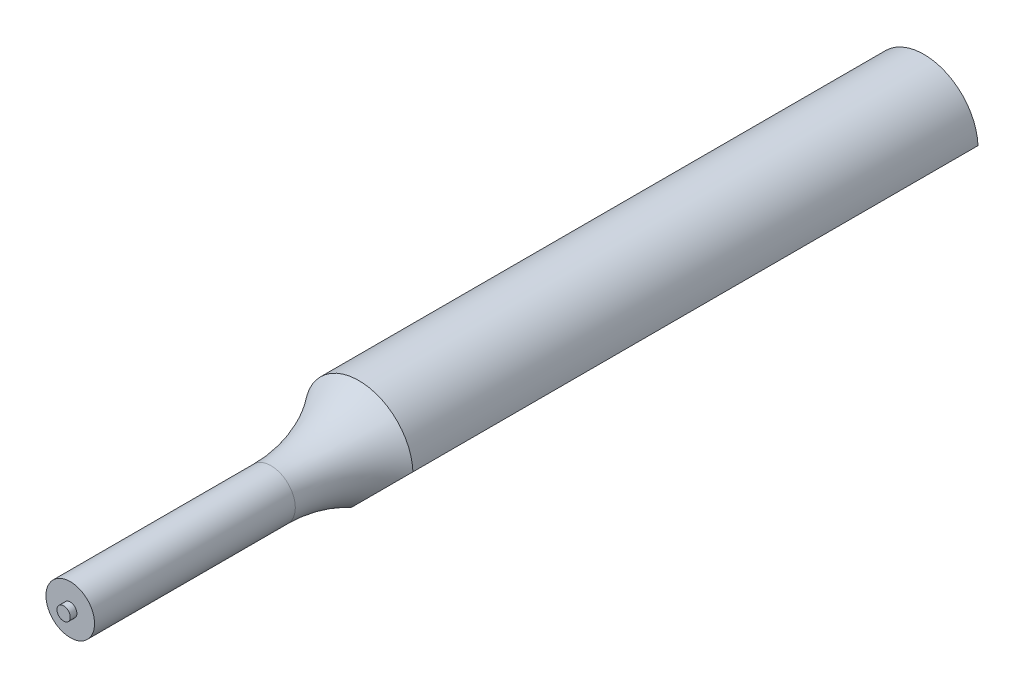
from build123d import *

# Parameters (mm, degrees)
LOGO3_BIB4_W       = 0.5842
LOGO3_BIB4_H       = 1.1684
CUT_EXTRUDE1_DEPTH = 77.01636322


with BuildPart() as part:
    # logo3_bib2 → Revolve2_Shoulder (revolve)
    with BuildSketch(Plane(origin=(0, 0, 0), x_dir=(1, 0, 0), z_dir=(0, 1, 0)), mode=Mode.PRIVATE) as revolve2_shoulder_sk:
        with BuildLine():
            Line((-4.7625, -6.35), (0, -6.35))
            Line((0, -6.35), (0, -81.4832))
            Line((0, -81.4832), (-2.13868, -81.4832))
            Line((-2.13868, -81.4832), (-2.13868, -63.813697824))
            ThreePointArc((-2.13868, -63.813697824), (-2.812510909, -59.731877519), (-4.7625, -56.0832))
            Line((-4.7625, -56.0832), (-4.7625, -6.35))
        make_face()
    revolve(revolve2_shoulder_sk.sketch.rotate(Axis((0, 0, 43.517168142), (0, 0, -1)), 180), axis=Axis((0, 0, 43.517168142), (0, 0, -1)))

    # logo3_bib4 → Revolve2_Shoulder_JT (revolve)
    with BuildSketch(Plane(origin=(0, 0, 0), x_dir=(1, 0, 0), z_dir=(0, 1, 0))):
        with Locations((-0.2921, -81.4832)):
            Rectangle(LOGO3_BIB4_W, LOGO3_BIB4_H)
    revolve(axis=Axis((0, 0, 0), (0, 0, 1)))

    # Sketch1_2 → Cut-Revolve_Ball_Shoulder (revolve, cut)
    with BuildSketch(Plane(origin=(0, 0, 0), x_dir=(1, 0, 0), z_dir=(0, 1, 0))):
        with BuildLine():
            Line((-12.410721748, -25.589774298), (-7.8105, -8.421513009))
            Line((-7.8105, -8.421513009), (-7.8105, -31.5849))
            ThreePointArc((-7.8105, -31.5849), (-11.588845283, -29.721626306), (-12.410721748, -25.589774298))
        make_face()
    revolve(axis=Axis((-7.8105, 0, 12.118432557), (0, 0, 1)), mode=Mode.SUBTRACT)

    # Sketch1 → Cut-Extrude1 (cut, through all)
    with BuildSketch(Plane(origin=(0, 0, 6.35), x_dir=(-1, 0, 0), z_dir=(0, 0, -1))):
        with BuildLine():
            Line((0.179196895, -4.759127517), (-4.759127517, 0.179196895))
            ThreePointArc((-4.759127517, 0.179196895), (-3.367596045, -3.367596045), (0.179196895, -4.759127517))
        make_face()
    extrude(amount=-CUT_EXTRUDE1_DEPTH, mode=Mode.SUBTRACT)


solid = part.part
